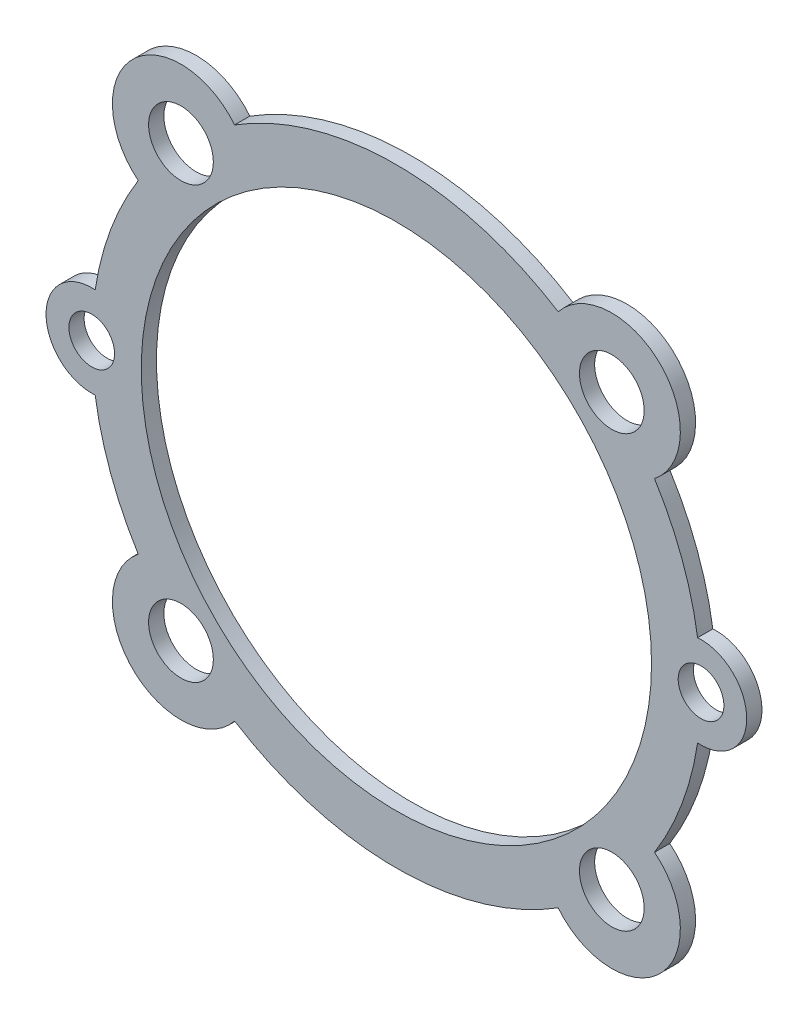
from build123d import *

# Parameters (mm, degrees)
SKETCH_1_R          = 33.5
EXTRUDE_1_DEPTH     = 2
HOLE_WIZARD_M10_1_D = 8.5
SKETCH_4_R          = 3
CUT_EXTRUDE_1_DEPTH = 61.991802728


with BuildPart() as part:
    # Sketch 1 → Extrude 1 (new body)
    with BuildSketch(Plane.XY):
        with BuildLine():
            ThreePointArc((33.891886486, 21.244764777), (34.648232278, 34.648232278), (21.244764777, 33.891886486))
            ThreePointArc((21.244764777, 33.891886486), (0, 40), (-21.244764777, 33.891886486))
            ThreePointArc((-21.244764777, 33.891886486), (-34.648232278, 34.648232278), (-33.891886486, 21.244764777))
            ThreePointArc((-33.891886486, 21.244764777), (-37.505429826, 13.90477377), (-39.55, 5.983101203))
            ThreePointArc((-39.55, 5.983101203), (-46, 0), (-39.55, -5.983101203))
            ThreePointArc((-39.55, -5.983101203), (-37.505429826, -13.90477377), (-33.891886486, -21.244764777))
            ThreePointArc((-33.891886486, -21.244764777), (-34.648232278, -34.648232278), (-21.244764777, -33.891886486))
            ThreePointArc((-21.244764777, -33.891886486), (0, -40), (21.244764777, -33.891886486))
            ThreePointArc((21.244764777, -33.891886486), (34.648232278, -34.648232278), (33.891886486, -21.244764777))
            ThreePointArc((33.891886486, -21.244764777), (37.505429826, -13.90477377), (39.55, -5.983101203))
            ThreePointArc((39.55, -5.983101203), (46, 0), (39.55, 5.983101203))
            ThreePointArc((39.55, 5.983101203), (37.505429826, 13.90477377), (33.891886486, 21.244764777))
        make_face()
        Circle(SKETCH_1_R, mode=Mode.SUBTRACT)
    extrude(amount=EXTRUDE_1_DEPTH)

    # Hole Wizard M10 _1 (through all)
    with Locations(Plane.XY.offset(2)):
        with Locations((-28.284271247, 28.284271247), (28.284271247, 28.284271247), (28.284271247, -28.284271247), (-28.284271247, -28.284271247)):
            Hole(HOLE_WIZARD_M10_1_D / 2)

    # Sketch 4 → Cut-Extrude 1 (cut, through all)
    with BuildSketch(Plane.XY.offset(2)):
        with Locations((40, 0)):
            Circle(SKETCH_4_R)
        with Locations((-40, 0)):
            Circle(SKETCH_4_R)
    extrude(amount=-CUT_EXTRUDE_1_DEPTH, mode=Mode.SUBTRACT)


solid = part.part
